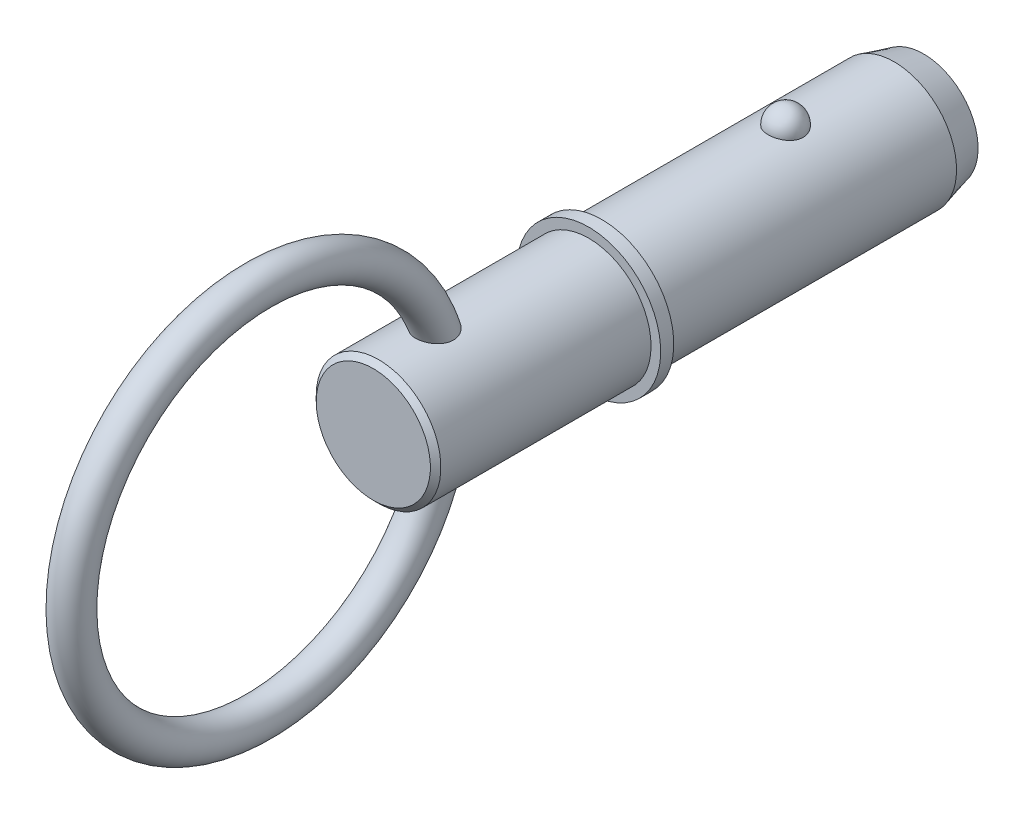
ISO-10303-21;
HEADER;
FILE_DESCRIPTION(('STEP AP214'),'2;1');
FILE_NAME('part.step','',(''),(''),'','','');
FILE_SCHEMA(('AUTOMOTIVE_DESIGN { 1 0 10303 214 1 1 1 1 }'));
ENDSEC;
DATA;
#1=APPLICATION_CONTEXT('core data for automotive mechanical design processes');
#2=APPLICATION_PROTOCOL_DEFINITION('international standard','automotive_design',2000,#1);
#3=PRODUCT_CONTEXT('',#1,'mechanical');
#4=PRODUCT('Part','Part','',(#3));
#5=PRODUCT_RELATED_PRODUCT_CATEGORY('part','',(#4));
#6=PRODUCT_DEFINITION_FORMATION('','',#4);
#7=PRODUCT_DEFINITION_CONTEXT('part definition',#1,'design');
#8=PRODUCT_DEFINITION('design','',#6,#7);
#9=PRODUCT_DEFINITION_SHAPE('','',#8);
#10=(LENGTH_UNIT() NAMED_UNIT(*) SI_UNIT(.MILLI.,.METRE.));
#11=(NAMED_UNIT(*) PLANE_ANGLE_UNIT() SI_UNIT($,.RADIAN.));
#12=(NAMED_UNIT(*) SI_UNIT($,.STERADIAN.) SOLID_ANGLE_UNIT());
#13=UNCERTAINTY_MEASURE_WITH_UNIT(LENGTH_MEASURE(1.E-05),#10,'distance_accuracy_value','');
#14=(GEOMETRIC_REPRESENTATION_CONTEXT(3) GLOBAL_UNCERTAINTY_ASSIGNED_CONTEXT((#13)) GLOBAL_UNIT_ASSIGNED_CONTEXT((#10,
#11,#12)) REPRESENTATION_CONTEXT('',''));
#15=CARTESIAN_POINT('',(0.,0.,0.));
#16=DIRECTION('',(0.,0.,1.));
#17=DIRECTION('',(1.,0.,0.));
#18=AXIS2_PLACEMENT_3D('',#15,#16,#17);
#19=CARTESIAN_POINT('',(0.,0.,25.4));
#20=DIRECTION('',(0.,0.,-1.));
#21=DIRECTION('',(-1.,0.,0.));
#22=AXIS2_PLACEMENT_3D('',#19,#20,#21);
#23=CYLINDRICAL_SURFACE('',#22,9.525);
#24=CARTESIAN_POINT('',(2.66304631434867,9.14515223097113,-2.68999999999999));
#25=CARTESIAN_POINT('',(2.66304388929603,9.14515434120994,-2.53964785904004));
#26=CARTESIAN_POINT('',(2.65079171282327,9.14874785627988,-2.38926509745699));
#27=CARTESIAN_POINT('',(2.60207590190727,9.16272073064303,-2.09276319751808));
#28=CARTESIAN_POINT('',(2.5656035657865,9.17310252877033,-1.94664561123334));
#29=CARTESIAN_POINT('',(2.469373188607,9.19947238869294,-1.66290124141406));
#30=CARTESIAN_POINT('',(2.40962536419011,9.215457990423,-1.52527076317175));
#31=CARTESIAN_POINT('',(2.26832639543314,9.25124900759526,-1.26225231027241));
#32=CARTESIAN_POINT('',(2.1867756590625,9.27105435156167,-1.13686410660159));
#33=CARTESIAN_POINT('',(2.00344089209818,9.3123948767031,-0.901158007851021));
#34=CARTESIAN_POINT('',(1.90155748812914,9.33393823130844,-0.790918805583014));
#35=CARTESIAN_POINT('',(1.68043702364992,9.37626794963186,-0.589299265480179));
#36=CARTESIAN_POINT('',(1.56119995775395,9.397054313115,-0.497918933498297));
#37=CARTESIAN_POINT('',(1.30893044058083,9.43549335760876,-0.336812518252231));
#38=CARTESIAN_POINT('',(1.17593917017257,9.45315498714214,-0.267024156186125));
#39=CARTESIAN_POINT('',(0.899596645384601,9.48344056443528,-0.150749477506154));
#40=CARTESIAN_POINT('',(0.756246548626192,9.49606507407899,-0.104260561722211));
#41=CARTESIAN_POINT('',(0.466048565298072,9.51468193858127,-0.0365733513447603));
#42=CARTESIAN_POINT('',(0.319312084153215,9.52079100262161,-0.0149294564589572));
#43=CARTESIAN_POINT('',(0.0241592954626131,9.52611235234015,0.00395337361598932));
#44=CARTESIAN_POINT('',(-0.124256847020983,9.5253253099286,0.0011946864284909));
#45=CARTESIAN_POINT('',(-0.41628168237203,9.51700443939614,-0.0284230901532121));
#46=CARTESIAN_POINT('',(-0.559928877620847,9.50956858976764,-0.0549321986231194));
#47=CARTESIAN_POINT('',(-0.840604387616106,9.48887888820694,-0.130816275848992));
#48=CARTESIAN_POINT('',(-0.977632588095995,9.47562493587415,-0.180191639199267));
#49=CARTESIAN_POINT('',(-1.24212223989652,9.44460733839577,-0.300803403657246));
#50=CARTESIAN_POINT('',(-1.36952298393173,9.42681774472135,-0.372166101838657));
#51=CARTESIAN_POINT('',(-1.61053183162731,9.38864858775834,-0.534729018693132));
#52=CARTESIAN_POINT('',(-1.72413851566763,9.36826875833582,-0.625931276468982));
#53=CARTESIAN_POINT('',(-1.9367483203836,9.32666137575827,-0.827716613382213));
#54=CARTESIAN_POINT('',(-2.03542624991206,9.3054250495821,-0.938640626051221));
#55=CARTESIAN_POINT('',(-2.21301001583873,9.26480083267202,-1.17562728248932));
#56=CARTESIAN_POINT('',(-2.29191442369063,9.24541307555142,-1.3016910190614));
#57=CARTESIAN_POINT('',(-2.4288038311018,9.21040769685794,-1.56709947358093));
#58=CARTESIAN_POINT('',(-2.48653332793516,9.19483682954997,-1.70658229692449));
#59=CARTESIAN_POINT('',(-2.57830950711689,9.16952722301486,-1.99363485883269));
#60=CARTESIAN_POINT('',(-2.61235688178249,9.1597883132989,-2.14120436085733));
#61=CARTESIAN_POINT('',(-2.65582131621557,9.14728131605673,-2.43957517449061));
#62=CARTESIAN_POINT('',(-2.66534248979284,9.14448376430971,-2.59036007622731));
#63=CARTESIAN_POINT('',(-2.659816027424,9.1460926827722,-2.89143694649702));
#64=CARTESIAN_POINT('',(-2.64476907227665,9.15049895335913,-3.04172892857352));
#65=CARTESIAN_POINT('',(-2.59062526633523,9.16597303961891,-3.3367616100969));
#66=CARTESIAN_POINT('',(-2.55165119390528,9.17700684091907,-3.48152666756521));
#67=CARTESIAN_POINT('',(-2.45072334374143,9.20447158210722,-3.7622672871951));
#68=CARTESIAN_POINT('',(-2.38876863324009,9.22090274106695,-3.89824249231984));
#69=CARTESIAN_POINT('',(-2.24300082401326,9.25744165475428,-4.15838266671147));
#70=CARTESIAN_POINT('',(-2.15906901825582,9.27756919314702,-4.28247834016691));
#71=CARTESIAN_POINT('',(-1.97161008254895,9.31920445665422,-4.51460755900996));
#72=CARTESIAN_POINT('',(-1.86808218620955,9.34071223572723,-4.62264047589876));
#73=CARTESIAN_POINT('',(-1.64365852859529,9.38280712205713,-4.82005417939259));
#74=CARTESIAN_POINT('',(-1.52269814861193,9.40339041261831,-4.90936239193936));
#75=CARTESIAN_POINT('',(-1.26696810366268,9.44124442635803,-5.06628635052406));
#76=CARTESIAN_POINT('',(-1.13219941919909,9.45851538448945,-5.13390363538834));
#77=CARTESIAN_POINT('',(-0.854427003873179,9.48761400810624,-5.24478918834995));
#78=CARTESIAN_POINT('',(-0.711548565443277,9.49950757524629,-5.28835378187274));
#79=CARTESIAN_POINT('',(-0.420167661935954,9.51684639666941,-5.35116010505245));
#80=CARTESIAN_POINT('',(-0.271665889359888,9.52229244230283,-5.3704048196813));
#81=CARTESIAN_POINT('',(0.0236961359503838,9.52609381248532,-5.38387805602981));
#82=CARTESIAN_POINT('',(0.170533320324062,9.52458300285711,-5.37857884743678));
#83=CARTESIAN_POINT('',(0.461166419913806,9.51494050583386,-5.34419624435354));
#84=CARTESIAN_POINT('',(0.604962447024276,9.50680906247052,-5.31511372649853));
#85=CARTESIAN_POINT('',(0.884899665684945,9.48484202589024,-5.23415185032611));
#86=CARTESIAN_POINT('',(1.02106863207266,9.47102889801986,-5.18236222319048));
#87=CARTESIAN_POINT('',(1.28268503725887,9.43915933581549,-5.05742910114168));
#88=CARTESIAN_POINT('',(1.40813178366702,9.421102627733,-4.98428422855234));
#89=CARTESIAN_POINT('',(1.64690915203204,9.38233399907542,-4.8172920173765));
#90=CARTESIAN_POINT('',(1.76002050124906,9.36158508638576,-4.72313982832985));
#91=CARTESIAN_POINT('',(1.96897358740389,9.31987907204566,-4.51732444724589));
#92=CARTESIAN_POINT('',(2.06481234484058,9.29892193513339,-4.40565824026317));
#93=CARTESIAN_POINT('',(2.23837433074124,9.25869342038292,-4.16566572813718));
#94=CARTESIAN_POINT('',(2.31574652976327,9.23945848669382,-4.03707931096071));
#95=CARTESIAN_POINT('',(2.44818540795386,9.20525491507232,-3.76840633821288));
#96=CARTESIAN_POINT('',(2.50325979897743,9.19028480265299,-3.6283237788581));
#97=CARTESIAN_POINT('',(2.58510224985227,9.16757716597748,-3.35610038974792));
#98=CARTESIAN_POINT('',(2.61427951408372,9.15923447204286,-3.2247283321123));
#99=CARTESIAN_POINT('',(2.6532524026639,9.14802112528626,-2.95891229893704));
#100=CARTESIAN_POINT('',(2.66304848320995,9.1451503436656,-2.82446839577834));
#101=CARTESIAN_POINT('',(2.66304631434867,9.14515223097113,-2.68999999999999));
#102=B_SPLINE_CURVE_WITH_KNOTS('',3,(#24,#25,#26,#27,#28,#29,#30,#31,#32,#33,#34,#35,#36,#37,
#38,#39,#40,#41,#42,#43,#44,#45,#46,#47,#48,#49,#50,#51,#52,#53,#54,#55,#56,#57,#58,#59,#60,#61,
#62,#63,#64,#65,#66,#67,#68,#69,#70,#71,#72,#73,#74,#75,#76,#77,#78,#79,#80,#81,#82,#83,#84,#85,
#86,#87,#88,#89,#90,#91,#92,#93,#94,#95,#96,#97,#98,#99,#100,#101),.UNSPECIFIED.,.T.,.F.,(4,2,2,
2,2,2,2,2,2,2,2,2,2,2,2,2,2,2,2,2,2,2,2,2,2,2,2,2,2,2,2,2,2,2,2,2,2,2,4),(0.,0.450573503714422,
0.901308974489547,1.35184682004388,1.80237623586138,2.25516399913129,2.70795190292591,
3.15942136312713,3.61084044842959,4.0540301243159,4.49717661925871,4.9338984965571,
5.37062791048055,5.80991423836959,6.24924573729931,6.69708004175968,7.1449466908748,
7.59805228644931,8.0511446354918,8.50231041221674,8.95346368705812,9.40232106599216,
9.85119666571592,10.3025487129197,10.7539184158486,11.2070064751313,11.6600623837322,
12.1074045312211,12.5546917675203,12.9934085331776,13.4321091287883,13.8690915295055,
14.3061021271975,14.7499227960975,15.1938199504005,15.6455814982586,16.0971866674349,
16.5001694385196,16.9031427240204),.UNSPECIFIED.);
#103=CARTESIAN_POINT('',(2.66304631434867,9.14515223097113,-2.68999999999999));
#104=VERTEX_POINT('',#103);
#105=EDGE_CURVE('E101',#104,#104,#102,.T.);
#106=ORIENTED_EDGE('',*,*,#105,.T.);
#107=EDGE_LOOP('',(#106));
#108=FACE_BOUND('',#107,.T.);
#109=CARTESIAN_POINT('',(0.,0.,-19.2999999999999));
#110=DIRECTION('',(0.,0.,-1.));
#111=DIRECTION('',(-1.,0.,0.));
#112=AXIS2_PLACEMENT_3D('',#109,#110,#111);
#113=CIRCLE('',#112,9.525);
#114=CARTESIAN_POINT('',(-9.525,0.,-19.2999999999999));
#115=VERTEX_POINT('',#114);
#116=EDGE_CURVE('E109',#115,#115,#113,.F.);
#117=ORIENTED_EDGE('',*,*,#116,.T.);
#118=EDGE_LOOP('',(#117));
#119=FACE_BOUND('',#118,.T.);
#120=CARTESIAN_POINT('',(0.,0.,25.4));
#121=DIRECTION('',(0.,0.,1.));
#122=DIRECTION('',(1.,0.,0.));
#123=AXIS2_PLACEMENT_3D('',#120,#121,#122);
#124=CIRCLE('',#123,9.525);
#125=CARTESIAN_POINT('',(9.525,0.,25.4));
#126=VERTEX_POINT('',#125);
#127=EDGE_CURVE('E107',#126,#126,#124,.T.);
#128=ORIENTED_EDGE('',*,*,#127,.F.);
#129=EDGE_LOOP('',(#128));
#130=FACE_BOUND('',#129,.T.);
#131=ADVANCED_FACE('F39',(#108,#119,#130),#23,.T.);
#132=CARTESIAN_POINT('',(0.,0.,-23.8));
#133=DIRECTION('',(0.,0.,-1.));
#134=DIRECTION('',(-1.,0.,0.));
#135=AXIS2_PLACEMENT_3D('',#132,#133,#134);
#136=PLANE('',#135);
#137=CARTESIAN_POINT('',(0.,0.,-23.8));
#138=DIRECTION('',(0.,0.,-1.));
#139=DIRECTION('',(-1.,0.,0.));
#140=AXIS2_PLACEMENT_3D('',#137,#138,#139);
#141=CIRCLE('',#140,8.31922863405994);
#142=CARTESIAN_POINT('',(-8.31922863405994,0.,-23.8));
#143=VERTEX_POINT('',#142);
#144=EDGE_CURVE('E141',#143,#143,#141,.T.);
#145=ORIENTED_EDGE('',*,*,#144,.T.);
#146=EDGE_LOOP('',(#145));
#147=FACE_BOUND('',#146,.T.);
#148=ADVANCED_FACE('F87',(#147),#136,.T.);
#149=CARTESIAN_POINT('',(0.,0.,-23.8));
#150=DIRECTION('',(0.,0.,1.));
#151=DIRECTION('',(1.,0.,0.));
#152=AXIS2_PLACEMENT_3D('',#149,#150,#151);
#153=CONICAL_SURFACE('',#152,8.31922863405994,0.261799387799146);
#154=ORIENTED_EDGE('',*,*,#116,.F.);
#155=EDGE_LOOP('',(#154));
#156=FACE_BOUND('',#155,.T.);
#157=ORIENTED_EDGE('',*,*,#144,.F.);
#158=EDGE_LOOP('',(#157));
#159=FACE_BOUND('',#158,.T.);
#160=ADVANCED_FACE('F93',(#156,#159),#153,.T.);
#161=CARTESIAN_POINT('',(0.,9.525,-2.68999999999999));
#162=DIRECTION('',(0.,1.,0.));
#163=DIRECTION('',(0.,0.,-1.));
#164=AXIS2_PLACEMENT_3D('',#161,#162,#163);
#165=SPHERICAL_SURFACE('',#164,2.69);
#166=ORIENTED_EDGE('',*,*,#105,.F.);
#167=EDGE_LOOP('',(#166));
#168=FACE_BOUND('',#167,.T.);
#169=ADVANCED_FACE('F112',(#168),#165,.T.);
#170=CARTESIAN_POINT('',(0.,0.,25.4));
#171=DIRECTION('',(0.,0.,-1.));
#172=DIRECTION('',(-1.,0.,0.));
#173=AXIS2_PLACEMENT_3D('',#170,#171,#172);
#174=PLANE('',#173);
#175=ORIENTED_EDGE('',*,*,#127,.T.);
#176=EDGE_LOOP('',(#175));
#177=FACE_BOUND('',#176,.T.);
#178=CARTESIAN_POINT('',(0.,0.,25.4));
#179=DIRECTION('',(0.,0.,-1.));
#180=DIRECTION('',(-1.,0.,0.));
#181=AXIS2_PLACEMENT_3D('',#178,#179,#180);
#182=CIRCLE('',#181,11.);
#183=CARTESIAN_POINT('',(-11.,0.,25.4));
#184=VERTEX_POINT('',#183);
#185=EDGE_CURVE('E108',#184,#184,#182,.T.);
#186=ORIENTED_EDGE('',*,*,#185,.T.);
#187=EDGE_LOOP('',(#186));
#188=FACE_BOUND('',#187,.T.);
#189=ADVANCED_FACE('F116',(#177,#188),#174,.T.);
#190=CARTESIAN_POINT('',(0.,0.,33.7287874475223));
#191=DIRECTION('',(0.,0.,-1.));
#192=DIRECTION('',(-1.,0.,0.));
#193=AXIS2_PLACEMENT_3D('',#190,#191,#192);
#194=CYLINDRICAL_SURFACE('',#193,11.);
#195=CARTESIAN_POINT('',(0.,0.,27.4));
#196=DIRECTION('',(0.,0.,-1.));
#197=DIRECTION('',(-1.,0.,0.));
#198=AXIS2_PLACEMENT_3D('',#195,#196,#197);
#199=CIRCLE('',#198,11.);
#200=CARTESIAN_POINT('',(-11.,0.,27.4));
#201=VERTEX_POINT('',#200);
#202=EDGE_CURVE('E133',#201,#201,#199,.T.);
#203=ORIENTED_EDGE('',*,*,#202,.T.);
#204=EDGE_LOOP('',(#203));
#205=FACE_BOUND('',#204,.T.);
#206=ORIENTED_EDGE('',*,*,#185,.F.);
#207=EDGE_LOOP('',(#206));
#208=FACE_BOUND('',#207,.T.);
#209=ADVANCED_FACE('F120',(#205,#208),#194,.T.);
#210=CARTESIAN_POINT('',(0.,11.,27.4));
#211=DIRECTION('',(0.,0.,1.));
#212=DIRECTION('',(1.,0.,0.));
#213=AXIS2_PLACEMENT_3D('',#210,#211,#212);
#214=PLANE('',#213);
#215=CARTESIAN_POINT('',(0.,0.,27.4));
#216=DIRECTION('',(0.,0.,1.));
#217=DIRECTION('',(1.,0.,0.));
#218=AXIS2_PLACEMENT_3D('',#215,#216,#217);
#219=CIRCLE('',#218,9.525);
#220=CARTESIAN_POINT('',(9.525,0.,27.4));
#221=VERTEX_POINT('',#220);
#222=EDGE_CURVE('E111',#221,#221,#219,.T.);
#223=ORIENTED_EDGE('',*,*,#222,.F.);
#224=EDGE_LOOP('',(#223));
#225=FACE_BOUND('',#224,.T.);
#226=ORIENTED_EDGE('',*,*,#202,.F.);
#227=EDGE_LOOP('',(#226));
#228=FACE_BOUND('',#227,.T.);
#229=ADVANCED_FACE('F84',(#225,#228),#214,.T.);
#230=CARTESIAN_POINT('',(0.,0.,60.33));
#231=DIRECTION('',(0.,0.,-1.));
#232=DIRECTION('',(-1.,0.,0.));
#233=AXIS2_PLACEMENT_3D('',#230,#231,#232);
#234=CYLINDRICAL_SURFACE('',#233,9.525);
#235=CARTESIAN_POINT('',(-1.17255022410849,-9.45255262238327,48.3156813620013));
#236=CARTESIAN_POINT('',(-1.03279041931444,-9.46988901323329,48.2520581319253));
#237=CARTESIAN_POINT('',(-0.887457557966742,-9.48474288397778,48.2000360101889));
#238=CARTESIAN_POINT('',(-0.589790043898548,-9.50789357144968,48.1203017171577));
#239=CARTESIAN_POINT('',(-0.437456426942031,-9.51619135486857,48.0925859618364));
#240=CARTESIAN_POINT('',(-0.130095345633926,-9.52535230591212,48.062037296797));
#241=CARTESIAN_POINT('',(0.024932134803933,-9.52621542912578,48.0592045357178));
#242=CARTESIAN_POINT('',(0.333291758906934,-9.5204161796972,48.0784804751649));
#243=CARTESIAN_POINT('',(0.486623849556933,-9.51375357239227,48.1005899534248));
#244=CARTESIAN_POINT('',(0.787326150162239,-9.49360162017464,48.1693091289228));
#245=CARTESIAN_POINT('',(0.934692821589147,-9.48010828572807,48.2159331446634));
#246=CARTESIAN_POINT('',(1.2191706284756,-9.44773819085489,48.332695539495));
#247=CARTESIAN_POINT('',(1.35628163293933,-9.42886136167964,48.4028342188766));
#248=CARTESIAN_POINT('',(1.61597534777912,-9.38783836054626,48.5648586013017));
#249=CARTESIAN_POINT('',(1.73859309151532,-9.36570037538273,48.6566901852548));
#250=CARTESIAN_POINT('',(1.96611924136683,-9.32059424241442,48.8599834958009));
#251=CARTESIAN_POINT('',(2.07103000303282,-9.29762620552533,48.9714426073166));
#252=CARTESIAN_POINT('',(2.25895856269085,-9.25375378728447,49.2095679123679));
#253=CARTESIAN_POINT('',(2.34223089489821,-9.23282741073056,49.3360291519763));
#254=CARTESIAN_POINT('',(2.48638570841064,-9.19505802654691,49.6016544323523));
#255=CARTESIAN_POINT('',(2.54727152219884,-9.17821441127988,49.7408165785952));
#256=CARTESIAN_POINT('',(2.64504150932,-9.15051673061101,50.0264509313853));
#257=CARTESIAN_POINT('',(2.68213620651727,-9.13961026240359,50.17284631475));
#258=CARTESIAN_POINT('',(2.73308631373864,-9.1245038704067,50.4699359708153));
#259=CARTESIAN_POINT('',(2.74693762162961,-9.12030513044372,50.6206309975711));
#260=CARTESIAN_POINT('',(2.75225289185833,-9.11870262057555,50.9282041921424));
#261=CARTESIAN_POINT('',(2.742835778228,-9.12156626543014,51.0850973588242));
#262=CARTESIAN_POINT('',(2.70120500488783,-9.1339786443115,51.3955303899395));
#263=CARTESIAN_POINT('',(2.66898313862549,-9.14352978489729,51.5490690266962));
#264=CARTESIAN_POINT('',(2.57915721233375,-9.16929474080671,51.8643171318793));
#265=CARTESIAN_POINT('',(2.51938387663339,-9.18606757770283,52.0253627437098));
#266=CARTESIAN_POINT('',(2.37615490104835,-9.22415241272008,52.3361129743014));
#267=CARTESIAN_POINT('',(2.29267648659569,-9.2454687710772,52.4858065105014));
#268=CARTESIAN_POINT('',(2.09570343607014,-9.29218719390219,52.7820058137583));
#269=CARTESIAN_POINT('',(1.98029238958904,-9.31778152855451,52.9272155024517));
#270=CARTESIAN_POINT('',(1.72523060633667,-9.36835235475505,53.194631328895));
#271=CARTESIAN_POINT('',(1.5856097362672,-9.39332956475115,53.3168654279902));
#272=CARTESIAN_POINT('',(1.31999418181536,-9.43381163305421,53.5065425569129));
#273=CARTESIAN_POINT('',(1.1984987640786,-9.45016352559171,53.5801115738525));
#274=CARTESIAN_POINT('',(0.944726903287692,-9.47889043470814,53.7065550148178));
#275=CARTESIAN_POINT('',(0.812460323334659,-9.4912690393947,53.7594481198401));
#276=CARTESIAN_POINT('',(0.539385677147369,-9.51070487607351,53.8415791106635));
#277=CARTESIAN_POINT('',(0.398529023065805,-9.51772807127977,53.870665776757));
#278=CARTESIAN_POINT('',(0.113692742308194,-9.52538430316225,53.9023462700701));
#279=CARTESIAN_POINT('',(-0.0302854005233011,-9.52602031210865,53.9049524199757));
#280=CARTESIAN_POINT('',(-0.301067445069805,-9.52110324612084,53.8846387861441));
#281=CARTESIAN_POINT('',(-0.42809194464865,-9.51619084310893,53.8643615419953));
#282=CARTESIAN_POINT('',(-0.676960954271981,-9.50173118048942,53.8037701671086));
#283=CARTESIAN_POINT('',(-0.798804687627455,-9.49218322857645,53.7634530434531));
#284=CARTESIAN_POINT('',(-1.03743276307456,-9.4691126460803,53.6637974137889));
#285=CARTESIAN_POINT('',(-1.15402581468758,-9.45550022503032,53.6040261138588));
#286=CARTESIAN_POINT('',(-1.37707059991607,-9.42560278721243,53.4684655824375));
#287=CARTESIAN_POINT('',(-1.48351822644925,-9.40931669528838,53.3926699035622));
#288=CARTESIAN_POINT('',(-1.70022776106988,-9.37276249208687,53.2152067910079));
#289=CARTESIAN_POINT('',(-1.80866644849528,-9.35226352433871,53.1113639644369));
#290=CARTESIAN_POINT('',(-2.00947431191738,-9.31118474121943,52.8891646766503));
#291=CARTESIAN_POINT('',(-2.10183201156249,-9.29060487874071,52.770797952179));
#292=CARTESIAN_POINT('',(-2.28343646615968,-9.24779116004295,52.5017233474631));
#293=CARTESIAN_POINT('',(-2.36963977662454,-9.22584708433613,52.3489048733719));
#294=CARTESIAN_POINT('',(-2.51731958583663,-9.18665215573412,52.0311082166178));
#295=CARTESIAN_POINT('',(-2.57878214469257,-9.16940395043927,51.8661232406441));
#296=CARTESIAN_POINT('',(-2.67771284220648,-9.14102404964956,51.517906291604));
#297=CARTESIAN_POINT('',(-2.71355979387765,-9.13031106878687,51.3341717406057));
#298=CARTESIAN_POINT('',(-2.75239325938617,-9.11868499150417,50.9629391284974));
#299=CARTESIAN_POINT('',(-2.75540326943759,-9.11776488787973,50.7754438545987));
#300=CARTESIAN_POINT('',(-2.72755769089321,-9.12612848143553,50.4182334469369));
#301=CARTESIAN_POINT('',(-2.69938579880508,-9.1346036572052,50.2482935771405));
#302=CARTESIAN_POINT('',(-2.6128234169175,-9.15973790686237,49.9169419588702));
#303=CARTESIAN_POINT('',(-2.5544530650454,-9.17639152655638,49.7555246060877));
#304=CARTESIAN_POINT('',(-2.41575064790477,-9.21381352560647,49.4622621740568));
#305=CARTESIAN_POINT('',(-2.33810564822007,-9.23402440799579,49.3290677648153));
#306=CARTESIAN_POINT('',(-2.1611059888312,-9.27704240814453,49.0784363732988));
#307=CARTESIAN_POINT('',(-2.06174995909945,-9.29984968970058,48.96100038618));
#308=CARTESIAN_POINT('',(-1.84046167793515,-9.34620233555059,48.7414448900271));
#309=CARTESIAN_POINT('',(-1.71787459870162,-9.36974632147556,48.63998498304));
#310=CARTESIAN_POINT('',(-1.45637301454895,-9.41393415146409,48.4600854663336));
#311=CARTESIAN_POINT('',(-1.31745717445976,-9.43457775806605,48.3816477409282));
#312=CARTESIAN_POINT('',(-1.17255022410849,-9.45255262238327,48.3156813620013));
#313=B_SPLINE_CURVE_WITH_KNOTS('',3,(#235,#236,#237,#238,#239,#240,#241,#242,#243,#244,#245,
#246,#247,#248,#249,#250,#251,#252,#253,#254,#255,#256,#257,#258,#259,#260,#261,#262,#263,#264,
#265,#266,#267,#268,#269,#270,#271,#272,#273,#274,#275,#276,#277,#278,#279,#280,#281,#282,#283,
#284,#285,#286,#287,#288,#289,#290,#291,#292,#293,#294,#295,#296,#297,#298,#299,#300,#301,#302,
#303,#304,#305,#306,#307,#308,#309,#310,#311,#312),.UNSPECIFIED.,.T.,.F.,(4,2,2,2,2,2,2,2,2,2,2,
2,2,2,2,2,2,2,2,2,2,2,2,2,2,2,2,2,2,2,2,2,2,2,2,2,2,2,4),(0.,0.463035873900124,
0.926003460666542,1.38897381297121,1.85195860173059,2.31521411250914,2.77847553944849,
3.24059321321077,3.70264936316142,4.1589953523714,4.61527338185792,5.06745604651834,
5.5197185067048,5.98936669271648,6.45918397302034,6.97482863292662,7.49097038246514,
8.04995658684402,8.60825803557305,9.03545685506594,9.46226879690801,9.89177127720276,
10.3210738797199,10.7054535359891,11.0898906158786,11.4835430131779,11.8773540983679,
12.3302409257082,12.7834496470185,13.311649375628,13.8401462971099,14.3996817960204,
14.9588168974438,15.4733264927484,15.9874934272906,16.451669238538,16.915874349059,
17.3959238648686,17.8760126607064),.UNSPECIFIED.);
#314=CARTESIAN_POINT('',(-1.17255022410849,-9.45255262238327,48.3156813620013));
#315=VERTEX_POINT('',#314);
#316=EDGE_CURVE('E10',#315,#315,#313,.T.);
#317=ORIENTED_EDGE('',*,*,#316,.F.);
#318=EDGE_LOOP('',(#317));
#319=FACE_BOUND('',#318,.T.);
#320=CARTESIAN_POINT('',(-1.17255022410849,9.45255262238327,48.3156813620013));
#321=CARTESIAN_POINT('',(-1.31058061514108,9.43543238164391,48.3785143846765));
#322=CARTESIAN_POINT('',(-1.44315063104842,9.41589375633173,48.4526513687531));
#323=CARTESIAN_POINT('',(-1.69365345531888,9.37407591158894,48.6218923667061));
#324=CARTESIAN_POINT('',(-1.81158925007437,9.35179725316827,48.7169920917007));
#325=CARTESIAN_POINT('',(-2.0295663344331,9.30692788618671,48.9259676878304));
#326=CARTESIAN_POINT('',(-2.12959463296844,9.28433696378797,49.0398570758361));
#327=CARTESIAN_POINT('',(-2.30883055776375,9.24139869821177,49.2833457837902));
#328=CARTESIAN_POINT('',(-2.38804080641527,9.22105107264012,49.4129431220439));
#329=CARTESIAN_POINT('',(-2.52289811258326,9.18506690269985,49.6826371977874));
#330=CARTESIAN_POINT('',(-2.57879510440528,9.16938093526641,49.8226025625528));
#331=CARTESIAN_POINT('',(-2.66732862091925,9.14402087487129,50.1101942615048));
#332=CARTESIAN_POINT('',(-2.6999643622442,9.13434698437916,50.2578208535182));
#333=CARTESIAN_POINT('',(-2.74234854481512,9.12171311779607,50.5587097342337));
#334=CARTESIAN_POINT('',(-2.75176419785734,9.11885078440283,50.7120223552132));
#335=CARTESIAN_POINT('',(-2.74768995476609,9.12007747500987,51.018282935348));
#336=CARTESIAN_POINT('',(-2.73419331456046,9.12416854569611,51.1712307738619));
#337=CARTESIAN_POINT('',(-2.68381401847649,9.13911977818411,51.4850489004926));
#338=CARTESIAN_POINT('',(-2.64520186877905,9.15047943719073,51.6456159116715));
#339=CARTESIAN_POINT('',(-2.54485320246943,9.17889121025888,51.9588781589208));
#340=CARTESIAN_POINT('',(-2.48309922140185,9.19594762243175,52.1115673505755));
#341=CARTESIAN_POINT('',(-2.33056913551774,9.23584987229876,52.4211220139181));
#342=CARTESIAN_POINT('',(-2.23745101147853,9.25911216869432,52.5767845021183));
#343=CARTESIAN_POINT('',(-2.02674425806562,9.307501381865,52.8702795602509));
#344=CARTESIAN_POINT('',(-1.90916388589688,9.33262766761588,53.0081181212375));
#345=CARTESIAN_POINT('',(-1.67044606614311,9.37804498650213,53.2420159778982));
#346=CARTESIAN_POINT('',(-1.55243875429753,9.39849934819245,53.3412400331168));
#347=CARTESIAN_POINT('',(-1.30125310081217,9.43654625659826,53.5191930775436));
#348=CARTESIAN_POINT('',(-1.16808326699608,9.45414039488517,53.5979334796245));
#349=CARTESIAN_POINT('',(-0.958516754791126,9.47691412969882,53.6976069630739));
#350=CARTESIAN_POINT('',(-0.886649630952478,9.48392776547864,53.7278606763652));
#351=CARTESIAN_POINT('',(-0.740281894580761,9.49647248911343,53.781484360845));
#352=CARTESIAN_POINT('',(-0.66578274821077,9.50200438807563,53.8048580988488));
#353=CARTESIAN_POINT('',(-0.514804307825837,9.51137811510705,53.8442294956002));
#354=CARTESIAN_POINT('',(-0.438326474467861,9.51522115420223,53.860232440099));
#355=CARTESIAN_POINT('',(-0.284116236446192,9.52107513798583,53.8845321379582));
#356=CARTESIAN_POINT('',(-0.206384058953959,9.52308641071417,53.8928302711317));
#357=CARTESIAN_POINT('',(0.00463957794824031,9.5259225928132,53.9045451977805));
#358=CARTESIAN_POINT('',(0.138460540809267,9.52491109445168,53.9003947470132));
#359=CARTESIAN_POINT('',(0.403152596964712,9.51738801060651,53.8692519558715));
#360=CARTESIAN_POINT('',(0.534023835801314,9.51087669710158,53.8422607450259));
#361=CARTESIAN_POINT('',(0.783985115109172,9.49347484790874,53.7688065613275));
#362=CARTESIAN_POINT('',(0.903337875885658,9.48277338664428,53.7231810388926));
#363=CARTESIAN_POINT('',(1.13363663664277,9.45800893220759,53.6149289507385));
#364=CARTESIAN_POINT('',(1.24458027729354,9.44394500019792,53.5522976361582));
#365=CARTESIAN_POINT('',(1.46880911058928,9.41182796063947,53.404389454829));
#366=CARTESIAN_POINT('',(1.58087386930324,9.3935013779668,53.3173287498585));
#367=CARTESIAN_POINT('',(1.79132420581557,9.35565274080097,53.1282478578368));
#368=CARTESIAN_POINT('',(1.88970126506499,9.33612995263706,53.0262184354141));
#369=CARTESIAN_POINT('',(2.08778125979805,9.29401761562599,52.7909975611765));
#370=CARTESIAN_POINT('',(2.18473298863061,9.27148591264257,52.65547341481));
#371=CARTESIAN_POINT('',(2.35733954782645,9.22911075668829,52.3710303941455));
#372=CARTESIAN_POINT('',(2.43297838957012,9.2092693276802,52.2221015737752));
#373=CARTESIAN_POINT('',(2.56843139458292,9.17247322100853,51.8972697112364));
#374=CARTESIAN_POINT('',(2.62561924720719,9.15606955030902,51.7201963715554));
#375=CARTESIAN_POINT('',(2.70930664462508,9.13166037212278,51.358330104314));
#376=CARTESIAN_POINT('',(2.73581406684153,9.12365270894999,51.1735391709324));
#377=CARTESIAN_POINT('',(2.7551261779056,9.11784049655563,50.8090170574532));
#378=CARTESIAN_POINT('',(2.74917791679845,9.11965839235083,50.6293617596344));
#379=CARTESIAN_POINT('',(2.70473277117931,9.13294027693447,50.274499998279));
#380=CARTESIAN_POINT('',(2.66626406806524,9.14439591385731,50.0992898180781));
#381=CARTESIAN_POINT('',(2.56263844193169,9.17393184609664,49.7784698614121));
#382=CARTESIAN_POINT('',(2.50080069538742,9.19116614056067,49.6317041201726));
#383=CARTESIAN_POINT('',(2.35244847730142,9.23024728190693,49.3518999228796));
#384=CARTESIAN_POINT('',(2.26593972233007,9.25209305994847,49.2188582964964));
#385=CARTESIAN_POINT('',(2.07585352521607,9.29652853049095,48.9771451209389));
#386=CARTESIAN_POINT('',(1.97340753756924,9.31901931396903,48.8675620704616));
#387=CARTESIAN_POINT('',(1.75142335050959,9.36327537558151,48.667179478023));
#388=CARTESIAN_POINT('',(1.63188535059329,9.38504066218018,48.5763797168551));
#389=CARTESIAN_POINT('',(1.37826267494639,9.42563474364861,48.4151683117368));
#390=CARTESIAN_POINT('',(1.24409194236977,9.44444438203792,48.3448873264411));
#391=CARTESIAN_POINT('',(0.965562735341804,9.47697010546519,48.2269968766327));
#392=CARTESIAN_POINT('',(0.821203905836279,9.4906860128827,48.1793882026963));
#393=CARTESIAN_POINT('',(0.524366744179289,9.51173338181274,48.1073692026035));
#394=CARTESIAN_POINT('',(0.371807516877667,9.5189799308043,48.0832670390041));
#395=CARTESIAN_POINT('',(0.0646112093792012,9.52602042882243,48.0598425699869));
#396=CARTESIAN_POINT('',(-0.0900262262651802,9.52581308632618,48.0605245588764));
#397=CARTESIAN_POINT('',(-0.404139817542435,9.51777767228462,48.0872769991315));
#398=CARTESIAN_POINT('',(-0.563508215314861,9.50959696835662,48.1145222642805));
#399=CARTESIAN_POINT('',(-0.874799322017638,9.48602809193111,48.1955333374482));
#400=CARTESIAN_POINT('',(-1.02672214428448,9.47064002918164,48.2492987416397));
#401=CARTESIAN_POINT('',(-1.17255022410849,9.45255262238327,48.3156813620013));
#402=B_SPLINE_CURVE_WITH_KNOTS('',3,(#320,#321,#322,#323,#324,#325,#326,#327,#328,#329,#330,
#331,#332,#333,#334,#335,#336,#337,#338,#339,#340,#341,#342,#343,#344,#345,#346,#347,#348,#349,
#350,#351,#352,#353,#354,#355,#356,#357,#358,#359,#360,#361,#362,#363,#364,#365,#366,#367,#368,
#369,#370,#371,#372,#373,#374,#375,#376,#377,#378,#379,#380,#381,#382,#383,#384,#385,#386,#387,
#388,#389,#390,#391,#392,#393,#394,#395,#396,#397,#398,#399,#400,#401),.UNSPECIFIED.,.T.,.F.,(4,
2,2,2,2,2,2,2,2,2,2,2,2,2,2,2,2,2,2,2,2,2,2,2,2,2,2,2,2,2,2,2,2,2,2,2,2,2,2,2,4),(0.,
0.45730654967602,0.914519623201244,1.37206305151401,1.82954881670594,2.28199545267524,
2.73445732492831,3.19336710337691,3.6524119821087,4.14699278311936,4.64194758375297,
5.18812269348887,5.73411374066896,6.19889752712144,6.66342179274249,6.89799214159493,
7.13243382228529,7.36670711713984,7.60093844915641,8.00032434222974,8.39969048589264,
8.78279802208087,9.16601265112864,9.5936670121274,10.0215863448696,10.5240084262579,
11.0268064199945,11.5844522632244,12.1419548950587,12.6781910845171,13.213963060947,
13.6920531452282,14.1700325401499,14.6229745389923,15.0759112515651,15.5316722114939,
15.9874490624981,16.4491237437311,16.9108784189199,17.3940267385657,17.8771677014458),.UNSPECIFIED.);
#403=CARTESIAN_POINT('',(-1.17255022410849,9.45255262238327,48.3156813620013));
#404=VERTEX_POINT('',#403);
#405=EDGE_CURVE('E51',#404,#404,#402,.T.);
#406=ORIENTED_EDGE('',*,*,#405,.F.);
#407=EDGE_LOOP('',(#406));
#408=FACE_BOUND('',#407,.T.);
#409=CARTESIAN_POINT('',(0.,0.,59.53));
#410=DIRECTION('',(0.,0.,-1.));
#411=DIRECTION('',(-1.,0.,0.));
#412=AXIS2_PLACEMENT_3D('',#409,#410,#411);
#413=CIRCLE('',#412,9.525);
#414=CARTESIAN_POINT('',(-9.525,0.,59.53));
#415=VERTEX_POINT('',#414);
#416=EDGE_CURVE('E63',#415,#415,#413,.T.);
#417=ORIENTED_EDGE('',*,*,#416,.T.);
#418=EDGE_LOOP('',(#417));
#419=FACE_BOUND('',#418,.T.);
#420=ORIENTED_EDGE('',*,*,#222,.T.);
#421=EDGE_LOOP('',(#420));
#422=FACE_BOUND('',#421,.T.);
#423=ADVANCED_FACE('F68',(#319,#408,#419,#422),#234,.T.);
#424=CARTESIAN_POINT('',(0.,0.,60.33));
#425=DIRECTION('',(0.,0.,-1.));
#426=DIRECTION('',(-1.,0.,0.));
#427=AXIS2_PLACEMENT_3D('',#424,#425,#426);
#428=PLANE('',#427);
#429=CARTESIAN_POINT('',(0.,0.,60.33));
#430=DIRECTION('',(0.,0.,-1.));
#431=DIRECTION('',(-1.,0.,0.));
#432=AXIS2_PLACEMENT_3D('',#429,#430,#431);
#433=CIRCLE('',#432,8.72499999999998);
#434=CARTESIAN_POINT('',(-8.72499999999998,0.,60.33));
#435=VERTEX_POINT('',#434);
#436=EDGE_CURVE('E58',#435,#435,#433,.F.);
#437=ORIENTED_EDGE('',*,*,#436,.T.);
#438=EDGE_LOOP('',(#437));
#439=FACE_BOUND('',#438,.T.);
#440=ADVANCED_FACE('F75',(#439),#428,.F.);
#441=CARTESIAN_POINT('',(0.,0.,59.53));
#442=DIRECTION('',(0.,0.,-1.));
#443=DIRECTION('',(-1.,0.,0.));
#444=AXIS2_PLACEMENT_3D('',#441,#442,#443);
#445=CONICAL_SURFACE('',#444,9.525,0.785398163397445);
#446=ORIENTED_EDGE('',*,*,#436,.F.);
#447=EDGE_LOOP('',(#446));
#448=FACE_BOUND('',#447,.T.);
#449=ORIENTED_EDGE('',*,*,#416,.F.);
#450=EDGE_LOOP('',(#449));
#451=FACE_BOUND('',#450,.T.);
#452=ADVANCED_FACE('F41',(#448,#451),#445,.T.);
#453=CARTESIAN_POINT('',(0.,0.,77.905));
#454=DIRECTION('',(1.,0.,0.));
#455=DIRECTION('',(0.,0.,-1.));
#456=AXIS2_PLACEMENT_3D('',#453,#454,#455);
#457=TOROIDAL_SURFACE('',#456,28.575,2.75);
#458=ORIENTED_EDGE('',*,*,#316,.T.);
#459=EDGE_LOOP('',(#458));
#460=FACE_BOUND('',#459,.T.);
#461=ORIENTED_EDGE('',*,*,#405,.T.);
#462=EDGE_LOOP('',(#461));
#463=FACE_BOUND('',#462,.T.);
#464=ADVANCED_FACE('F72',(#460,#463),#457,.T.);
#465=CLOSED_SHELL('',(#131,#148,#160,#169,#189,#209,#229,#423,#440,#452,#464));
#466=MANIFOLD_SOLID_BREP('B2',#465);
#467=ADVANCED_BREP_SHAPE_REPRESENTATION('',(#18,#466),#14);
#468=SHAPE_DEFINITION_REPRESENTATION(#9,#467);
ENDSEC;
END-ISO-10303-21;
